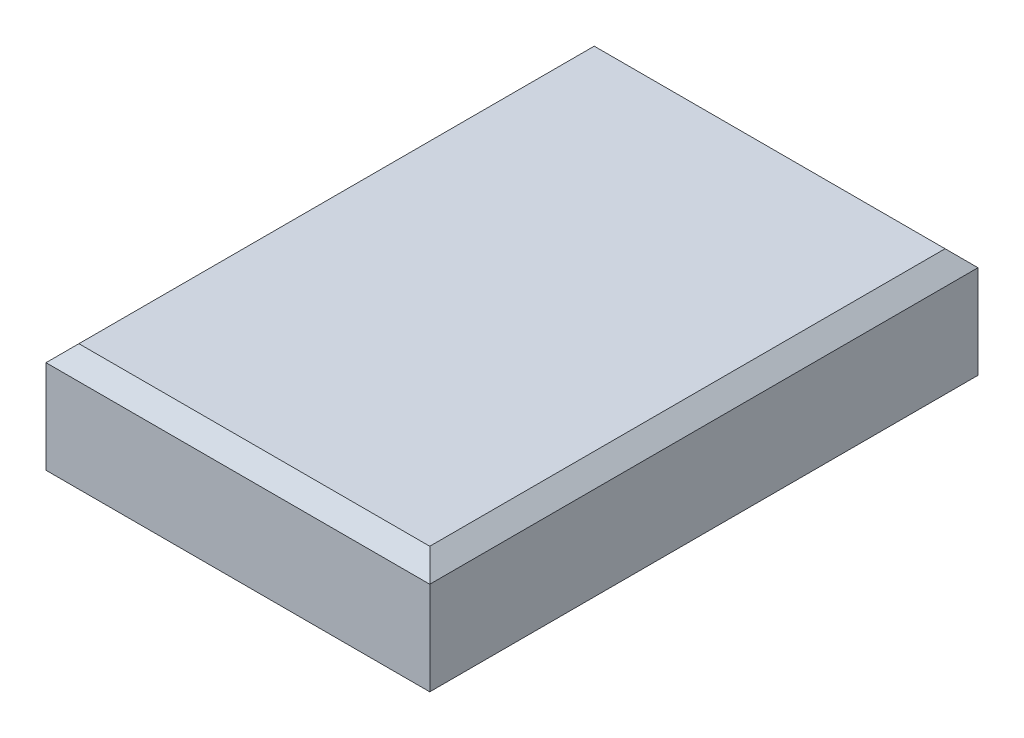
ISO-10303-21;
HEADER;
FILE_DESCRIPTION(('STEP AP214'),'2;1');
FILE_NAME('part.step','',(''),(''),'','','');
FILE_SCHEMA(('AUTOMOTIVE_DESIGN { 1 0 10303 214 1 1 1 1 }'));
ENDSEC;
DATA;
#1=APPLICATION_CONTEXT('core data for automotive mechanical design processes');
#2=APPLICATION_PROTOCOL_DEFINITION('international standard','automotive_design',2000,#1);
#3=PRODUCT_CONTEXT('',#1,'mechanical');
#4=PRODUCT('Part','Part','',(#3));
#5=PRODUCT_RELATED_PRODUCT_CATEGORY('part','',(#4));
#6=PRODUCT_DEFINITION_FORMATION('','',#4);
#7=PRODUCT_DEFINITION_CONTEXT('part definition',#1,'design');
#8=PRODUCT_DEFINITION('design','',#6,#7);
#9=PRODUCT_DEFINITION_SHAPE('','',#8);
#10=(LENGTH_UNIT() NAMED_UNIT(*) SI_UNIT(.MILLI.,.METRE.));
#11=(NAMED_UNIT(*) PLANE_ANGLE_UNIT() SI_UNIT($,.RADIAN.));
#12=(NAMED_UNIT(*) SI_UNIT($,.STERADIAN.) SOLID_ANGLE_UNIT());
#13=UNCERTAINTY_MEASURE_WITH_UNIT(LENGTH_MEASURE(1.E-05),#10,'distance_accuracy_value','');
#14=(GEOMETRIC_REPRESENTATION_CONTEXT(3) GLOBAL_UNCERTAINTY_ASSIGNED_CONTEXT((#13)) GLOBAL_UNIT_ASSIGNED_CONTEXT((#10,
#11,#12)) REPRESENTATION_CONTEXT('',''));
#15=CARTESIAN_POINT('',(0.,0.,0.));
#16=DIRECTION('',(0.,0.,1.));
#17=DIRECTION('',(1.,0.,0.));
#18=AXIS2_PLACEMENT_3D('',#15,#16,#17);
#19=CARTESIAN_POINT('',(35.,20.,50.));
#20=DIRECTION('',(-1.,0.,0.));
#21=DIRECTION('',(0.,0.,1.));
#22=AXIS2_PLACEMENT_3D('',#19,#20,#21);
#23=PLANE('',#22);
#24=DIRECTION('',(0.,-1.,0.));
#25=VECTOR('',#24,1.);
#26=CARTESIAN_POINT('',(35.,20.,-50.));
#27=LINE('',#26,#25);
#28=CARTESIAN_POINT('',(35.,17.,-50.));
#29=VERTEX_POINT('',#28);
#30=CARTESIAN_POINT('',(35.,0.,-50.));
#31=VERTEX_POINT('',#30);
#32=EDGE_CURVE('E92',#29,#31,#27,.T.);
#33=ORIENTED_EDGE('',*,*,#32,.F.);
#34=DIRECTION('',(0.,0.,1.));
#35=VECTOR('',#34,1.);
#36=CARTESIAN_POINT('',(35.,17.,50.));
#37=LINE('',#36,#35);
#38=CARTESIAN_POINT('',(35.,17.,50.));
#39=VERTEX_POINT('',#38);
#40=EDGE_CURVE('E11',#29,#39,#37,.T.);
#41=ORIENTED_EDGE('',*,*,#40,.T.);
#42=DIRECTION('',(0.,-1.,0.));
#43=VECTOR('',#42,1.);
#44=CARTESIAN_POINT('',(35.,20.,50.));
#45=LINE('',#44,#43);
#46=CARTESIAN_POINT('',(35.,0.,50.));
#47=VERTEX_POINT('',#46);
#48=EDGE_CURVE('E112',#39,#47,#45,.T.);
#49=ORIENTED_EDGE('',*,*,#48,.T.);
#50=DIRECTION('',(0.,0.,-1.));
#51=VECTOR('',#50,1.);
#52=CARTESIAN_POINT('',(35.,0.,50.));
#53=LINE('',#52,#51);
#54=EDGE_CURVE('E107',#47,#31,#53,.T.);
#55=ORIENTED_EDGE('',*,*,#54,.T.);
#56=EDGE_LOOP('',(#33,#41,#49,#55));
#57=FACE_BOUND('',#56,.T.);
#58=ADVANCED_FACE('F39',(#57),#23,.F.);
#59=CARTESIAN_POINT('',(-35.,20.,-50.));
#60=DIRECTION('',(0.,0.,1.));
#61=DIRECTION('',(1.,0.,0.));
#62=AXIS2_PLACEMENT_3D('',#59,#60,#61);
#63=PLANE('',#62);
#64=DIRECTION('',(0.,-1.,0.));
#65=VECTOR('',#64,1.);
#66=CARTESIAN_POINT('',(-35.,20.,-50.));
#67=LINE('',#66,#65);
#68=CARTESIAN_POINT('',(-35.,17.,-50.));
#69=VERTEX_POINT('',#68);
#70=CARTESIAN_POINT('',(-35.,0.,-50.));
#71=VERTEX_POINT('',#70);
#72=EDGE_CURVE('E101',#69,#71,#67,.T.);
#73=ORIENTED_EDGE('',*,*,#72,.F.);
#74=DIRECTION('',(1.,0.,0.));
#75=VECTOR('',#74,1.);
#76=CARTESIAN_POINT('',(-35.,17.,-50.));
#77=LINE('',#76,#75);
#78=EDGE_CURVE('E49',#69,#29,#77,.T.);
#79=ORIENTED_EDGE('',*,*,#78,.T.);
#80=ORIENTED_EDGE('',*,*,#32,.T.);
#81=DIRECTION('',(-1.,0.,0.));
#82=VECTOR('',#81,1.);
#83=CARTESIAN_POINT('',(-35.,0.,-50.));
#84=LINE('',#83,#82);
#85=EDGE_CURVE('E95',#31,#71,#84,.T.);
#86=ORIENTED_EDGE('',*,*,#85,.T.);
#87=EDGE_LOOP('',(#73,#79,#80,#86));
#88=FACE_BOUND('',#87,.T.);
#89=ADVANCED_FACE('F94',(#88),#63,.F.);
#90=CARTESIAN_POINT('',(-35.,20.,50.));
#91=DIRECTION('',(1.,0.,0.));
#92=DIRECTION('',(0.,0.,-1.));
#93=AXIS2_PLACEMENT_3D('',#90,#91,#92);
#94=PLANE('',#93);
#95=DIRECTION('',(0.,-1.,0.));
#96=VECTOR('',#95,1.);
#97=CARTESIAN_POINT('',(-35.,20.,50.));
#98=LINE('',#97,#96);
#99=CARTESIAN_POINT('',(-35.,17.,50.));
#100=VERTEX_POINT('',#99);
#101=CARTESIAN_POINT('',(-35.,0.,50.));
#102=VERTEX_POINT('',#101);
#103=EDGE_CURVE('E122',#100,#102,#98,.T.);
#104=ORIENTED_EDGE('',*,*,#103,.F.);
#105=DIRECTION('',(0.,0.,-1.));
#106=VECTOR('',#105,1.);
#107=CARTESIAN_POINT('',(-35.,17.,50.));
#108=LINE('',#107,#106);
#109=EDGE_CURVE('E64',#100,#69,#108,.T.);
#110=ORIENTED_EDGE('',*,*,#109,.T.);
#111=ORIENTED_EDGE('',*,*,#72,.T.);
#112=DIRECTION('',(0.,0.,1.));
#113=VECTOR('',#112,1.);
#114=CARTESIAN_POINT('',(-35.,0.,50.));
#115=LINE('',#114,#113);
#116=EDGE_CURVE('E109',#71,#102,#115,.T.);
#117=ORIENTED_EDGE('',*,*,#116,.T.);
#118=EDGE_LOOP('',(#104,#110,#111,#117));
#119=FACE_BOUND('',#118,.T.);
#120=ADVANCED_FACE('F160',(#119),#94,.F.);
#121=CARTESIAN_POINT('',(-35.,20.,50.));
#122=DIRECTION('',(0.,0.,-1.));
#123=DIRECTION('',(-1.,0.,0.));
#124=AXIS2_PLACEMENT_3D('',#121,#122,#123);
#125=PLANE('',#124);
#126=ORIENTED_EDGE('',*,*,#48,.F.);
#127=DIRECTION('',(-1.,0.,0.));
#128=VECTOR('',#127,1.);
#129=CARTESIAN_POINT('',(-35.,17.,50.));
#130=LINE('',#129,#128);
#131=EDGE_CURVE('E133',#39,#100,#130,.T.);
#132=ORIENTED_EDGE('',*,*,#131,.T.);
#133=ORIENTED_EDGE('',*,*,#103,.T.);
#134=DIRECTION('',(1.,0.,0.));
#135=VECTOR('',#134,1.);
#136=CARTESIAN_POINT('',(-35.,0.,50.));
#137=LINE('',#136,#135);
#138=EDGE_CURVE('E119',#102,#47,#137,.T.);
#139=ORIENTED_EDGE('',*,*,#138,.T.);
#140=EDGE_LOOP('',(#126,#132,#133,#139));
#141=FACE_BOUND('',#140,.T.);
#142=ADVANCED_FACE('F159',(#141),#125,.F.);
#143=CARTESIAN_POINT('',(0.,20.,0.));
#144=DIRECTION('',(0.,-1.,0.));
#145=DIRECTION('',(0.,0.,-1.));
#146=AXIS2_PLACEMENT_3D('',#143,#144,#145);
#147=PLANE('',#146);
#148=DIRECTION('',(0.,0.,1.));
#149=VECTOR('',#148,1.);
#150=CARTESIAN_POINT('',(-32.,20.,0.));
#151=LINE('',#150,#149);
#152=CARTESIAN_POINT('',(-32.,20.,-47.));
#153=VERTEX_POINT('',#152);
#154=CARTESIAN_POINT('',(-32.,20.,47.));
#155=VERTEX_POINT('',#154);
#156=EDGE_CURVE('E128',#153,#155,#151,.T.);
#157=ORIENTED_EDGE('',*,*,#156,.T.);
#158=DIRECTION('',(1.,0.,0.));
#159=VECTOR('',#158,1.);
#160=CARTESIAN_POINT('',(0.,20.,47.));
#161=LINE('',#160,#159);
#162=CARTESIAN_POINT('',(32.,20.,47.));
#163=VERTEX_POINT('',#162);
#164=EDGE_CURVE('E130',#155,#163,#161,.T.);
#165=ORIENTED_EDGE('',*,*,#164,.T.);
#166=DIRECTION('',(0.,0.,-1.));
#167=VECTOR('',#166,1.);
#168=CARTESIAN_POINT('',(32.,20.,0.));
#169=LINE('',#168,#167);
#170=CARTESIAN_POINT('',(32.,20.,-47.));
#171=VERTEX_POINT('',#170);
#172=EDGE_CURVE('E100',#163,#171,#169,.T.);
#173=ORIENTED_EDGE('',*,*,#172,.T.);
#174=DIRECTION('',(-1.,0.,0.));
#175=VECTOR('',#174,1.);
#176=CARTESIAN_POINT('',(0.,20.,-47.));
#177=LINE('',#176,#175);
#178=EDGE_CURVE('E126',#171,#153,#177,.T.);
#179=ORIENTED_EDGE('',*,*,#178,.T.);
#180=EDGE_LOOP('',(#157,#165,#173,#179));
#181=FACE_BOUND('',#180,.T.);
#182=ADVANCED_FACE('F152',(#181),#147,.F.);
#183=CARTESIAN_POINT('',(0.,0.,0.));
#184=DIRECTION('',(0.,-1.,0.));
#185=DIRECTION('',(0.,0.,-1.));
#186=AXIS2_PLACEMENT_3D('',#183,#184,#185);
#187=PLANE('',#186);
#188=ORIENTED_EDGE('',*,*,#54,.F.);
#189=ORIENTED_EDGE('',*,*,#138,.F.);
#190=ORIENTED_EDGE('',*,*,#116,.F.);
#191=ORIENTED_EDGE('',*,*,#85,.F.);
#192=EDGE_LOOP('',(#188,#189,#190,#191));
#193=FACE_BOUND('',#192,.T.);
#194=ADVANCED_FACE('F105',(#193),#187,.T.);
#195=CARTESIAN_POINT('',(0.,20.,-47.));
#196=DIRECTION('',(0.,-0.707106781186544,0.707106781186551));
#197=DIRECTION('',(-1.,0.,0.));
#198=AXIS2_PLACEMENT_3D('',#195,#196,#197);
#199=PLANE('',#198);
#200=DIRECTION('',(-0.577350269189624,0.577350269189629,0.577350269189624));
#201=VECTOR('',#200,1.);
#202=CARTESIAN_POINT('',(16.3333333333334,35.6666666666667,-31.3333333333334));
#203=LINE('',#202,#201);
#204=EDGE_CURVE('E116',#29,#171,#203,.T.);
#205=ORIENTED_EDGE('',*,*,#204,.F.);
#206=ORIENTED_EDGE('',*,*,#78,.F.);
#207=DIRECTION('',(0.577350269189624,0.577350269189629,0.577350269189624));
#208=VECTOR('',#207,1.);
#209=CARTESIAN_POINT('',(-21.3333333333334,30.6666666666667,-36.3333333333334));
#210=LINE('',#209,#208);
#211=EDGE_CURVE('E44',#153,#69,#210,.F.);
#212=ORIENTED_EDGE('',*,*,#211,.F.);
#213=ORIENTED_EDGE('',*,*,#178,.F.);
#214=EDGE_LOOP('',(#205,#206,#212,#213));
#215=FACE_BOUND('',#214,.T.);
#216=ADVANCED_FACE('F42',(#215),#199,.F.);
#217=CARTESIAN_POINT('',(-32.,20.,0.));
#218=DIRECTION('',(0.707106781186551,-0.707106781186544,0.));
#219=DIRECTION('',(0.,0.,1.));
#220=AXIS2_PLACEMENT_3D('',#217,#218,#219);
#221=PLANE('',#220);
#222=ORIENTED_EDGE('',*,*,#211,.T.);
#223=ORIENTED_EDGE('',*,*,#109,.F.);
#224=DIRECTION('',(0.577350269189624,0.577350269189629,-0.577350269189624));
#225=VECTOR('',#224,1.);
#226=CARTESIAN_POINT('',(-16.3333333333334,35.6666666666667,31.3333333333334));
#227=LINE('',#226,#225);
#228=EDGE_CURVE('E140',#155,#100,#227,.F.);
#229=ORIENTED_EDGE('',*,*,#228,.F.);
#230=ORIENTED_EDGE('',*,*,#156,.F.);
#231=EDGE_LOOP('',(#222,#223,#229,#230));
#232=FACE_BOUND('',#231,.T.);
#233=ADVANCED_FACE('F184',(#232),#221,.F.);
#234=CARTESIAN_POINT('',(32.,20.,0.));
#235=DIRECTION('',(-0.707106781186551,-0.707106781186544,0.));
#236=DIRECTION('',(0.,0.,-1.));
#237=AXIS2_PLACEMENT_3D('',#234,#235,#236);
#238=PLANE('',#237);
#239=ORIENTED_EDGE('',*,*,#204,.T.);
#240=ORIENTED_EDGE('',*,*,#172,.F.);
#241=DIRECTION('',(0.577350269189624,-0.577350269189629,0.577350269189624));
#242=VECTOR('',#241,1.);
#243=CARTESIAN_POINT('',(16.3333333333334,35.6666666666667,31.3333333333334));
#244=LINE('',#243,#242);
#245=EDGE_CURVE('E138',#39,#163,#244,.F.);
#246=ORIENTED_EDGE('',*,*,#245,.F.);
#247=ORIENTED_EDGE('',*,*,#40,.F.);
#248=EDGE_LOOP('',(#239,#240,#246,#247));
#249=FACE_BOUND('',#248,.T.);
#250=ADVANCED_FACE('F145',(#249),#238,.F.);
#251=CARTESIAN_POINT('',(0.,20.,47.));
#252=DIRECTION('',(0.,-0.707106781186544,-0.707106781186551));
#253=DIRECTION('',(1.,0.,0.));
#254=AXIS2_PLACEMENT_3D('',#251,#252,#253);
#255=PLANE('',#254);
#256=ORIENTED_EDGE('',*,*,#228,.T.);
#257=ORIENTED_EDGE('',*,*,#131,.F.);
#258=ORIENTED_EDGE('',*,*,#245,.T.);
#259=ORIENTED_EDGE('',*,*,#164,.F.);
#260=EDGE_LOOP('',(#256,#257,#258,#259));
#261=FACE_BOUND('',#260,.T.);
#262=ADVANCED_FACE('F156',(#261),#255,.F.);
#263=CLOSED_SHELL('',(#58,#89,#120,#142,#182,#194,#216,#233,#250,#262));
#264=MANIFOLD_SOLID_BREP('B2',#263);
#265=ADVANCED_BREP_SHAPE_REPRESENTATION('',(#18,#264),#14);
#266=SHAPE_DEFINITION_REPRESENTATION(#9,#265);
ENDSEC;
END-ISO-10303-21;
